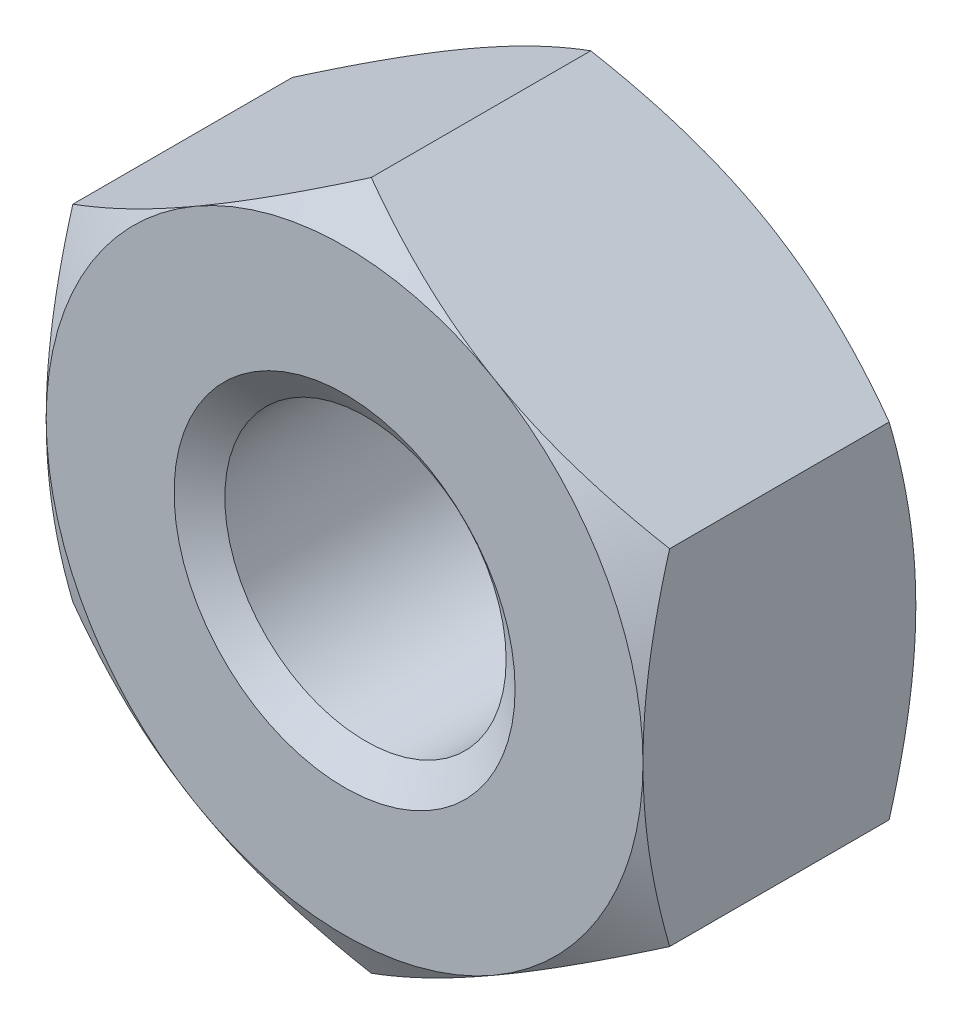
from build123d import *

# Parameters (mm, degrees)
BASENUTSKE_R  = 1.65
BASENUT_DEPTH = 3.2


with BuildPart() as part:
    # BaseNutSke → BaseNut (new body)
    with BuildSketch(Plane.XY):
        Polygon((3.5, 2.020725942), (3.5, -2.020725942), (0, -4.041451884), (-3.5, -2.020725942), (-3.5, 2.020725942), (0, 4.041451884), align=None)
        Circle(BASENUTSKE_R, mode=Mode.SUBTRACT)
    extrude(amount=-BASENUT_DEPTH)

    # Sketch3 → Double-Chamfer (revolve, cut)
    with BuildSketch(Plane(origin=(0, 0, 0), x_dir=(0, 0, -1), z_dir=(1, 0, 0)), mode=Mode.PRIVATE) as double_chamfer_sk:
        Polygon((3.2, 3.5), (2.887392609, 4.041451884), (2.887392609, 14.041451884), (13.2, 14.041451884), (13.2, 3.5), align=None)
        Polygon((0.312607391, 14.041451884), (-10, 14.041451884), (-10, 3.5), (0, 3.5), (0.312607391, 4.041451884), align=None)
    revolve(double_chamfer_sk.sketch.rotate(Axis((0, 0, 0), (0, 0, -1)), 90), axis=Axis((0, 0, 0), (0, 0, -1)), mode=Mode.SUBTRACT)

    # Sketch5 → EndChamfer (revolve, cut)
    with BuildSketch(Plane(origin=(0, 0, 0), x_dir=(0, 0, -1), z_dir=(1, 0, 0)), mode=Mode.PRIVATE) as endchamfer_sk:
        Polygon((3.1746, 2), (2.905020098, 1.615), (3.2254, 1.615), (3.2254, 2), align=None)
        Polygon((-0.0508, 2), (0, 2), (0.269579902, 1.615), (-0.0508, 1.615), align=None)
    revolve(endchamfer_sk.sketch.rotate(Axis((0, 0, -25.037505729), (0, 0, -1)), 90), axis=Axis((0, 0, -25.037505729), (0, 0, -1)), mode=Mode.SUBTRACT)


solid = part.part
